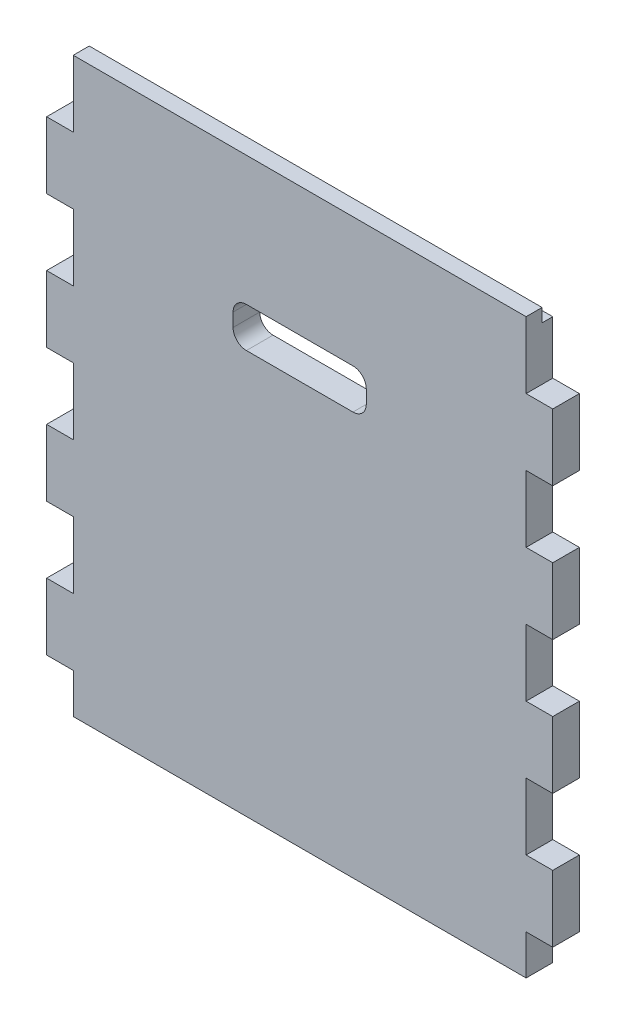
ISO-10303-21;
HEADER;
FILE_DESCRIPTION(('STEP AP214'),'2;1');
FILE_NAME('part.step','',(''),(''),'','','');
FILE_SCHEMA(('AUTOMOTIVE_DESIGN { 1 0 10303 214 1 1 1 1 }'));
ENDSEC;
DATA;
#1=APPLICATION_CONTEXT('core data for automotive mechanical design processes');
#2=APPLICATION_PROTOCOL_DEFINITION('international standard','automotive_design',2000,#1);
#3=PRODUCT_CONTEXT('',#1,'mechanical');
#4=PRODUCT('Part','Part','',(#3));
#5=PRODUCT_RELATED_PRODUCT_CATEGORY('part','',(#4));
#6=PRODUCT_DEFINITION_FORMATION('','',#4);
#7=PRODUCT_DEFINITION_CONTEXT('part definition',#1,'design');
#8=PRODUCT_DEFINITION('design','',#6,#7);
#9=PRODUCT_DEFINITION_SHAPE('','',#8);
#10=(LENGTH_UNIT() NAMED_UNIT(*) SI_UNIT(.MILLI.,.METRE.));
#11=(NAMED_UNIT(*) PLANE_ANGLE_UNIT() SI_UNIT($,.RADIAN.));
#12=(NAMED_UNIT(*) SI_UNIT($,.STERADIAN.) SOLID_ANGLE_UNIT());
#13=UNCERTAINTY_MEASURE_WITH_UNIT(LENGTH_MEASURE(1.E-05),#10,'distance_accuracy_value','');
#14=(GEOMETRIC_REPRESENTATION_CONTEXT(3) GLOBAL_UNCERTAINTY_ASSIGNED_CONTEXT((#13)) GLOBAL_UNIT_ASSIGNED_CONTEXT((#10,
#11,#12)) REPRESENTATION_CONTEXT('',''));
#15=CARTESIAN_POINT('',(0.,0.,0.));
#16=DIRECTION('',(0.,0.,1.));
#17=DIRECTION('',(1.,0.,0.));
#18=AXIS2_PLACEMENT_3D('',#15,#16,#17);
#19=CARTESIAN_POINT('',(19.9999999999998,450.,20.));
#20=DIRECTION('',(0.,-1.,0.));
#21=DIRECTION('',(0.,0.,-1.));
#22=AXIS2_PLACEMENT_3D('',#19,#20,#21);
#23=PLANE('',#22);
#24=DIRECTION('',(1.,0.,0.));
#25=VECTOR('',#24,1.);
#26=CARTESIAN_POINT('',(360.,450.,8.));
#27=LINE('',#26,#25);
#28=CARTESIAN_POINT('',(19.9999999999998,450.,8.));
#29=VERTEX_POINT('',#28);
#30=CARTESIAN_POINT('',(360.,450.,8.));
#31=VERTEX_POINT('',#30);
#32=EDGE_CURVE('E335',#29,#31,#27,.T.);
#33=ORIENTED_EDGE('',*,*,#32,.F.);
#34=DIRECTION('',(0.,0.,-1.));
#35=VECTOR('',#34,1.);
#36=CARTESIAN_POINT('',(19.9999999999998,450.,20.));
#37=LINE('',#36,#35);
#38=CARTESIAN_POINT('',(19.9999999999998,450.,20.));
#39=VERTEX_POINT('',#38);
#40=EDGE_CURVE('E604',#39,#29,#37,.T.);
#41=ORIENTED_EDGE('',*,*,#40,.F.);
#42=DIRECTION('',(-1.,0.,0.));
#43=VECTOR('',#42,1.);
#44=CARTESIAN_POINT('',(19.9999999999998,450.,20.));
#45=LINE('',#44,#43);
#46=CARTESIAN_POINT('',(360.,450.,20.));
#47=VERTEX_POINT('',#46);
#48=EDGE_CURVE('E454',#47,#39,#45,.T.);
#49=ORIENTED_EDGE('',*,*,#48,.F.);
#50=DIRECTION('',(0.,0.,-1.));
#51=VECTOR('',#50,1.);
#52=CARTESIAN_POINT('',(360.,450.,20.));
#53=LINE('',#52,#51);
#54=EDGE_CURVE('E607',#47,#31,#53,.T.);
#55=ORIENTED_EDGE('',*,*,#54,.T.);
#56=EDGE_LOOP('',(#33,#41,#49,#55));
#57=FACE_BOUND('',#56,.T.);
#58=ADVANCED_FACE('F31',(#57),#23,.F.);
#59=CARTESIAN_POINT('',(19.9999999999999,20.,20.));
#60=DIRECTION('',(1.,0.,0.));
#61=DIRECTION('',(0.,1.,0.));
#62=AXIS2_PLACEMENT_3D('',#59,#60,#61);
#63=PLANE('',#62);
#64=DIRECTION('',(0.,-1.,0.));
#65=VECTOR('',#64,1.);
#66=CARTESIAN_POINT('',(19.9999999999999,20.,0.));
#67=LINE('',#66,#65);
#68=CARTESIAN_POINT('',(20.,50.,0.));
#69=VERTEX_POINT('',#68);
#70=CARTESIAN_POINT('',(19.9999999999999,20.,0.));
#71=VERTEX_POINT('',#70);
#72=EDGE_CURVE('E400',#69,#71,#67,.T.);
#73=ORIENTED_EDGE('',*,*,#72,.T.);
#74=DIRECTION('',(0.,0.,-1.));
#75=VECTOR('',#74,1.);
#76=CARTESIAN_POINT('',(19.9999999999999,20.,20.));
#77=LINE('',#76,#75);
#78=CARTESIAN_POINT('',(19.9999999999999,20.,20.));
#79=VERTEX_POINT('',#78);
#80=EDGE_CURVE('E11',#79,#71,#77,.T.);
#81=ORIENTED_EDGE('',*,*,#80,.F.);
#82=DIRECTION('',(0.,-1.,0.));
#83=VECTOR('',#82,1.);
#84=CARTESIAN_POINT('',(19.9999999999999,20.,20.));
#85=LINE('',#84,#83);
#86=CARTESIAN_POINT('',(20.,50.,20.));
#87=VERTEX_POINT('',#86);
#88=EDGE_CURVE('E414',#87,#79,#85,.T.);
#89=ORIENTED_EDGE('',*,*,#88,.F.);
#90=DIRECTION('',(0.,0.,-1.));
#91=VECTOR('',#90,1.);
#92=CARTESIAN_POINT('',(20.,50.,20.));
#93=LINE('',#92,#91);
#94=EDGE_CURVE('E488',#87,#69,#93,.T.);
#95=ORIENTED_EDGE('',*,*,#94,.T.);
#96=EDGE_LOOP('',(#73,#81,#89,#95));
#97=FACE_BOUND('',#96,.T.);
#98=ADVANCED_FACE('F33',(#97),#63,.F.);
#99=CARTESIAN_POINT('',(360.,20.,20.));
#100=DIRECTION('',(0.,1.,0.));
#101=DIRECTION('',(-1.,0.,0.));
#102=AXIS2_PLACEMENT_3D('',#99,#100,#101);
#103=PLANE('',#102);
#104=DIRECTION('',(1.,0.,0.));
#105=VECTOR('',#104,1.);
#106=CARTESIAN_POINT('',(360.,20.,0.));
#107=LINE('',#106,#105);
#108=CARTESIAN_POINT('',(360.,20.,0.));
#109=VERTEX_POINT('',#108);
#110=EDGE_CURVE('E491',#71,#109,#107,.T.);
#111=ORIENTED_EDGE('',*,*,#110,.T.);
#112=DIRECTION('',(0.,0.,-1.));
#113=VECTOR('',#112,1.);
#114=CARTESIAN_POINT('',(360.,20.,20.));
#115=LINE('',#114,#113);
#116=CARTESIAN_POINT('',(360.,20.,20.));
#117=VERTEX_POINT('',#116);
#118=EDGE_CURVE('E39',#117,#109,#115,.T.);
#119=ORIENTED_EDGE('',*,*,#118,.F.);
#120=DIRECTION('',(1.,0.,0.));
#121=VECTOR('',#120,1.);
#122=CARTESIAN_POINT('',(360.,20.,20.));
#123=LINE('',#122,#121);
#124=EDGE_CURVE('E417',#79,#117,#123,.T.);
#125=ORIENTED_EDGE('',*,*,#124,.F.);
#126=ORIENTED_EDGE('',*,*,#80,.T.);
#127=EDGE_LOOP('',(#111,#119,#125,#126));
#128=FACE_BOUND('',#127,.T.);
#129=ADVANCED_FACE('F684',(#128),#103,.F.);
#130=CARTESIAN_POINT('',(360.,50.,20.));
#131=DIRECTION('',(-1.,0.,0.));
#132=DIRECTION('',(0.,0.,1.));
#133=AXIS2_PLACEMENT_3D('',#130,#131,#132);
#134=PLANE('',#133);
#135=DIRECTION('',(0.,1.,0.));
#136=VECTOR('',#135,1.);
#137=CARTESIAN_POINT('',(360.,50.,0.));
#138=LINE('',#137,#136);
#139=CARTESIAN_POINT('',(360.,50.,0.));
#140=VERTEX_POINT('',#139);
#141=EDGE_CURVE('E493',#109,#140,#138,.T.);
#142=ORIENTED_EDGE('',*,*,#141,.T.);
#143=DIRECTION('',(0.,0.,-1.));
#144=VECTOR('',#143,1.);
#145=CARTESIAN_POINT('',(360.,50.,20.));
#146=LINE('',#145,#144);
#147=CARTESIAN_POINT('',(360.,50.,20.));
#148=VERTEX_POINT('',#147);
#149=EDGE_CURVE('E653',#148,#140,#146,.T.);
#150=ORIENTED_EDGE('',*,*,#149,.F.);
#151=DIRECTION('',(0.,1.,0.));
#152=VECTOR('',#151,1.);
#153=CARTESIAN_POINT('',(360.,50.,20.));
#154=LINE('',#153,#152);
#155=EDGE_CURVE('E420',#117,#148,#154,.T.);
#156=ORIENTED_EDGE('',*,*,#155,.F.);
#157=ORIENTED_EDGE('',*,*,#118,.T.);
#158=EDGE_LOOP('',(#142,#150,#156,#157));
#159=FACE_BOUND('',#158,.T.);
#160=ADVANCED_FACE('F660',(#159),#134,.F.);
#161=CARTESIAN_POINT('',(360.,50.,20.));
#162=DIRECTION('',(0.,1.,0.));
#163=DIRECTION('',(-1.,0.,0.));
#164=AXIS2_PLACEMENT_3D('',#161,#162,#163);
#165=PLANE('',#164);
#166=DIRECTION('',(1.,0.,0.));
#167=VECTOR('',#166,1.);
#168=CARTESIAN_POINT('',(360.,50.,0.));
#169=LINE('',#168,#167);
#170=CARTESIAN_POINT('',(380.,50.,0.));
#171=VERTEX_POINT('',#170);
#172=EDGE_CURVE('E495',#140,#171,#169,.T.);
#173=ORIENTED_EDGE('',*,*,#172,.T.);
#174=DIRECTION('',(0.,0.,-1.));
#175=VECTOR('',#174,1.);
#176=CARTESIAN_POINT('',(380.,50.,20.));
#177=LINE('',#176,#175);
#178=CARTESIAN_POINT('',(380.,50.,20.));
#179=VERTEX_POINT('',#178);
#180=EDGE_CURVE('E650',#179,#171,#177,.T.);
#181=ORIENTED_EDGE('',*,*,#180,.F.);
#182=DIRECTION('',(1.,0.,0.));
#183=VECTOR('',#182,1.);
#184=CARTESIAN_POINT('',(360.,50.,20.));
#185=LINE('',#184,#183);
#186=EDGE_CURVE('E422',#148,#179,#185,.T.);
#187=ORIENTED_EDGE('',*,*,#186,.F.);
#188=ORIENTED_EDGE('',*,*,#149,.T.);
#189=EDGE_LOOP('',(#173,#181,#187,#188));
#190=FACE_BOUND('',#189,.T.);
#191=ADVANCED_FACE('F672',(#190),#165,.F.);
#192=CARTESIAN_POINT('',(380.,50.,20.));
#193=DIRECTION('',(-1.,0.,0.));
#194=DIRECTION('',(0.,-1.,0.));
#195=AXIS2_PLACEMENT_3D('',#192,#193,#194);
#196=PLANE('',#195);
#197=DIRECTION('',(0.,1.,0.));
#198=VECTOR('',#197,1.);
#199=CARTESIAN_POINT('',(380.,50.,0.));
#200=LINE('',#199,#198);
#201=CARTESIAN_POINT('',(380.,100.,0.));
#202=VERTEX_POINT('',#201);
#203=EDGE_CURVE('E497',#171,#202,#200,.T.);
#204=ORIENTED_EDGE('',*,*,#203,.T.);
#205=DIRECTION('',(0.,0.,-1.));
#206=VECTOR('',#205,1.);
#207=CARTESIAN_POINT('',(380.,100.,20.));
#208=LINE('',#207,#206);
#209=CARTESIAN_POINT('',(380.,100.,20.));
#210=VERTEX_POINT('',#209);
#211=EDGE_CURVE('E647',#210,#202,#208,.T.);
#212=ORIENTED_EDGE('',*,*,#211,.F.);
#213=DIRECTION('',(0.,1.,0.));
#214=VECTOR('',#213,1.);
#215=CARTESIAN_POINT('',(380.,50.,20.));
#216=LINE('',#215,#214);
#217=EDGE_CURVE('E424',#179,#210,#216,.T.);
#218=ORIENTED_EDGE('',*,*,#217,.F.);
#219=ORIENTED_EDGE('',*,*,#180,.T.);
#220=EDGE_LOOP('',(#204,#212,#218,#219));
#221=FACE_BOUND('',#220,.T.);
#222=ADVANCED_FACE('F676',(#221),#196,.F.);
#223=CARTESIAN_POINT('',(360.,100.,20.));
#224=DIRECTION('',(0.,-1.,0.));
#225=DIRECTION('',(1.,0.,0.));
#226=AXIS2_PLACEMENT_3D('',#223,#224,#225);
#227=PLANE('',#226);
#228=DIRECTION('',(-1.,0.,0.));
#229=VECTOR('',#228,1.);
#230=CARTESIAN_POINT('',(360.,100.,0.));
#231=LINE('',#230,#229);
#232=CARTESIAN_POINT('',(360.,100.,0.));
#233=VERTEX_POINT('',#232);
#234=EDGE_CURVE('E499',#202,#233,#231,.T.);
#235=ORIENTED_EDGE('',*,*,#234,.T.);
#236=DIRECTION('',(0.,0.,-1.));
#237=VECTOR('',#236,1.);
#238=CARTESIAN_POINT('',(360.,100.,20.));
#239=LINE('',#238,#237);
#240=CARTESIAN_POINT('',(360.,100.,20.));
#241=VERTEX_POINT('',#240);
#242=EDGE_CURVE('E644',#241,#233,#239,.T.);
#243=ORIENTED_EDGE('',*,*,#242,.F.);
#244=DIRECTION('',(-1.,0.,0.));
#245=VECTOR('',#244,1.);
#246=CARTESIAN_POINT('',(360.,100.,20.));
#247=LINE('',#246,#245);
#248=EDGE_CURVE('E426',#210,#241,#247,.T.);
#249=ORIENTED_EDGE('',*,*,#248,.F.);
#250=ORIENTED_EDGE('',*,*,#211,.T.);
#251=EDGE_LOOP('',(#235,#243,#249,#250));
#252=FACE_BOUND('',#251,.T.);
#253=ADVANCED_FACE('F832',(#252),#227,.F.);
#254=CARTESIAN_POINT('',(360.,150.,20.));
#255=DIRECTION('',(-1.,0.,0.));
#256=DIRECTION('',(0.,0.,1.));
#257=AXIS2_PLACEMENT_3D('',#254,#255,#256);
#258=PLANE('',#257);
#259=DIRECTION('',(0.,1.,0.));
#260=VECTOR('',#259,1.);
#261=CARTESIAN_POINT('',(360.,150.,0.));
#262=LINE('',#261,#260);
#263=CARTESIAN_POINT('',(360.,150.,0.));
#264=VERTEX_POINT('',#263);
#265=EDGE_CURVE('E501',#233,#264,#262,.T.);
#266=ORIENTED_EDGE('',*,*,#265,.T.);
#267=DIRECTION('',(0.,0.,-1.));
#268=VECTOR('',#267,1.);
#269=CARTESIAN_POINT('',(360.,150.,20.));
#270=LINE('',#269,#268);
#271=CARTESIAN_POINT('',(360.,150.,20.));
#272=VERTEX_POINT('',#271);
#273=EDGE_CURVE('E641',#272,#264,#270,.T.);
#274=ORIENTED_EDGE('',*,*,#273,.F.);
#275=DIRECTION('',(0.,1.,0.));
#276=VECTOR('',#275,1.);
#277=CARTESIAN_POINT('',(360.,150.,20.));
#278=LINE('',#277,#276);
#279=EDGE_CURVE('E428',#241,#272,#278,.T.);
#280=ORIENTED_EDGE('',*,*,#279,.F.);
#281=ORIENTED_EDGE('',*,*,#242,.T.);
#282=EDGE_LOOP('',(#266,#274,#280,#281));
#283=FACE_BOUND('',#282,.T.);
#284=ADVANCED_FACE('F830',(#283),#258,.F.);
#285=CARTESIAN_POINT('',(360.,150.,20.));
#286=DIRECTION('',(0.,1.,0.));
#287=DIRECTION('',(0.,0.,1.));
#288=AXIS2_PLACEMENT_3D('',#285,#286,#287);
#289=PLANE('',#288);
#290=DIRECTION('',(1.,0.,0.));
#291=VECTOR('',#290,1.);
#292=CARTESIAN_POINT('',(360.,150.,0.));
#293=LINE('',#292,#291);
#294=CARTESIAN_POINT('',(379.999999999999,150.,0.));
#295=VERTEX_POINT('',#294);
#296=EDGE_CURVE('E503',#264,#295,#293,.T.);
#297=ORIENTED_EDGE('',*,*,#296,.T.);
#298=DIRECTION('',(0.,0.,-1.));
#299=VECTOR('',#298,1.);
#300=CARTESIAN_POINT('',(379.999999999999,150.,20.));
#301=LINE('',#300,#299);
#302=CARTESIAN_POINT('',(379.999999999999,150.,20.));
#303=VERTEX_POINT('',#302);
#304=EDGE_CURVE('E638',#303,#295,#301,.T.);
#305=ORIENTED_EDGE('',*,*,#304,.F.);
#306=DIRECTION('',(1.,0.,0.));
#307=VECTOR('',#306,1.);
#308=CARTESIAN_POINT('',(360.,150.,20.));
#309=LINE('',#308,#307);
#310=EDGE_CURVE('E430',#272,#303,#309,.T.);
#311=ORIENTED_EDGE('',*,*,#310,.F.);
#312=ORIENTED_EDGE('',*,*,#273,.T.);
#313=EDGE_LOOP('',(#297,#305,#311,#312));
#314=FACE_BOUND('',#313,.T.);
#315=ADVANCED_FACE('F825',(#314),#289,.F.);
#316=CARTESIAN_POINT('',(379.999999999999,150.,20.));
#317=DIRECTION('',(-1.,0.,0.));
#318=DIRECTION('',(0.,-1.,0.));
#319=AXIS2_PLACEMENT_3D('',#316,#317,#318);
#320=PLANE('',#319);
#321=DIRECTION('',(0.,1.,0.));
#322=VECTOR('',#321,1.);
#323=CARTESIAN_POINT('',(379.999999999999,150.,0.));
#324=LINE('',#323,#322);
#325=CARTESIAN_POINT('',(379.999999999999,200.,0.));
#326=VERTEX_POINT('',#325);
#327=EDGE_CURVE('E505',#295,#326,#324,.T.);
#328=ORIENTED_EDGE('',*,*,#327,.T.);
#329=DIRECTION('',(0.,0.,-1.));
#330=VECTOR('',#329,1.);
#331=CARTESIAN_POINT('',(379.999999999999,200.,20.));
#332=LINE('',#331,#330);
#333=CARTESIAN_POINT('',(379.999999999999,200.,20.));
#334=VERTEX_POINT('',#333);
#335=EDGE_CURVE('E635',#334,#326,#332,.T.);
#336=ORIENTED_EDGE('',*,*,#335,.F.);
#337=DIRECTION('',(0.,1.,0.));
#338=VECTOR('',#337,1.);
#339=CARTESIAN_POINT('',(379.999999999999,150.,20.));
#340=LINE('',#339,#338);
#341=EDGE_CURVE('E432',#303,#334,#340,.T.);
#342=ORIENTED_EDGE('',*,*,#341,.F.);
#343=ORIENTED_EDGE('',*,*,#304,.T.);
#344=EDGE_LOOP('',(#328,#336,#342,#343));
#345=FACE_BOUND('',#344,.T.);
#346=ADVANCED_FACE('F820',(#345),#320,.F.);
#347=CARTESIAN_POINT('',(360.,200.,20.));
#348=DIRECTION('',(0.,-1.,0.));
#349=DIRECTION('',(0.,0.,-1.));
#350=AXIS2_PLACEMENT_3D('',#347,#348,#349);
#351=PLANE('',#350);
#352=DIRECTION('',(-1.,0.,0.));
#353=VECTOR('',#352,1.);
#354=CARTESIAN_POINT('',(360.,200.,0.));
#355=LINE('',#354,#353);
#356=CARTESIAN_POINT('',(360.,200.,0.));
#357=VERTEX_POINT('',#356);
#358=EDGE_CURVE('E507',#326,#357,#355,.T.);
#359=ORIENTED_EDGE('',*,*,#358,.T.);
#360=DIRECTION('',(0.,0.,-1.));
#361=VECTOR('',#360,1.);
#362=CARTESIAN_POINT('',(360.,200.,20.));
#363=LINE('',#362,#361);
#364=CARTESIAN_POINT('',(360.,200.,20.));
#365=VERTEX_POINT('',#364);
#366=EDGE_CURVE('E632',#365,#357,#363,.T.);
#367=ORIENTED_EDGE('',*,*,#366,.F.);
#368=DIRECTION('',(-1.,0.,0.));
#369=VECTOR('',#368,1.);
#370=CARTESIAN_POINT('',(360.,200.,20.));
#371=LINE('',#370,#369);
#372=EDGE_CURVE('E434',#334,#365,#371,.T.);
#373=ORIENTED_EDGE('',*,*,#372,.F.);
#374=ORIENTED_EDGE('',*,*,#335,.T.);
#375=EDGE_LOOP('',(#359,#367,#373,#374));
#376=FACE_BOUND('',#375,.T.);
#377=ADVANCED_FACE('F816',(#376),#351,.F.);
#378=CARTESIAN_POINT('',(360.,250.,20.));
#379=DIRECTION('',(-1.,0.,0.));
#380=DIRECTION('',(0.,-1.,0.));
#381=AXIS2_PLACEMENT_3D('',#378,#379,#380);
#382=PLANE('',#381);
#383=DIRECTION('',(0.,1.,0.));
#384=VECTOR('',#383,1.);
#385=CARTESIAN_POINT('',(360.,250.,0.));
#386=LINE('',#385,#384);
#387=CARTESIAN_POINT('',(360.,250.,0.));
#388=VERTEX_POINT('',#387);
#389=EDGE_CURVE('E509',#357,#388,#386,.T.);
#390=ORIENTED_EDGE('',*,*,#389,.T.);
#391=DIRECTION('',(0.,0.,-1.));
#392=VECTOR('',#391,1.);
#393=CARTESIAN_POINT('',(360.,250.,20.));
#394=LINE('',#393,#392);
#395=CARTESIAN_POINT('',(360.,250.,20.));
#396=VERTEX_POINT('',#395);
#397=EDGE_CURVE('E629',#396,#388,#394,.T.);
#398=ORIENTED_EDGE('',*,*,#397,.F.);
#399=DIRECTION('',(0.,1.,0.));
#400=VECTOR('',#399,1.);
#401=CARTESIAN_POINT('',(360.,250.,20.));
#402=LINE('',#401,#400);
#403=EDGE_CURVE('E436',#365,#396,#402,.T.);
#404=ORIENTED_EDGE('',*,*,#403,.F.);
#405=ORIENTED_EDGE('',*,*,#366,.T.);
#406=EDGE_LOOP('',(#390,#398,#404,#405));
#407=FACE_BOUND('',#406,.T.);
#408=ADVANCED_FACE('F811',(#407),#382,.F.);
#409=CARTESIAN_POINT('',(360.,250.,20.));
#410=DIRECTION('',(0.,1.,0.));
#411=DIRECTION('',(0.,0.,1.));
#412=AXIS2_PLACEMENT_3D('',#409,#410,#411);
#413=PLANE('',#412);
#414=DIRECTION('',(1.,0.,0.));
#415=VECTOR('',#414,1.);
#416=CARTESIAN_POINT('',(360.,250.,0.));
#417=LINE('',#416,#415);
#418=CARTESIAN_POINT('',(379.999999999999,250.,0.));
#419=VERTEX_POINT('',#418);
#420=EDGE_CURVE('E511',#388,#419,#417,.T.);
#421=ORIENTED_EDGE('',*,*,#420,.T.);
#422=DIRECTION('',(0.,0.,-1.));
#423=VECTOR('',#422,1.);
#424=CARTESIAN_POINT('',(379.999999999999,250.,20.));
#425=LINE('',#424,#423);
#426=CARTESIAN_POINT('',(379.999999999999,250.,20.));
#427=VERTEX_POINT('',#426);
#428=EDGE_CURVE('E626',#427,#419,#425,.T.);
#429=ORIENTED_EDGE('',*,*,#428,.F.);
#430=DIRECTION('',(1.,0.,0.));
#431=VECTOR('',#430,1.);
#432=CARTESIAN_POINT('',(360.,250.,20.));
#433=LINE('',#432,#431);
#434=EDGE_CURVE('E438',#396,#427,#433,.T.);
#435=ORIENTED_EDGE('',*,*,#434,.F.);
#436=ORIENTED_EDGE('',*,*,#397,.T.);
#437=EDGE_LOOP('',(#421,#429,#435,#436));
#438=FACE_BOUND('',#437,.T.);
#439=ADVANCED_FACE('F805',(#438),#413,.F.);
#440=CARTESIAN_POINT('',(379.999999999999,250.,20.));
#441=DIRECTION('',(-1.,0.,0.));
#442=DIRECTION('',(0.,-1.,0.));
#443=AXIS2_PLACEMENT_3D('',#440,#441,#442);
#444=PLANE('',#443);
#445=DIRECTION('',(0.,1.,0.));
#446=VECTOR('',#445,1.);
#447=CARTESIAN_POINT('',(379.999999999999,250.,0.));
#448=LINE('',#447,#446);
#449=CARTESIAN_POINT('',(379.999999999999,300.,0.));
#450=VERTEX_POINT('',#449);
#451=EDGE_CURVE('E513',#419,#450,#448,.T.);
#452=ORIENTED_EDGE('',*,*,#451,.T.);
#453=DIRECTION('',(0.,0.,-1.));
#454=VECTOR('',#453,1.);
#455=CARTESIAN_POINT('',(379.999999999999,300.,20.));
#456=LINE('',#455,#454);
#457=CARTESIAN_POINT('',(379.999999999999,300.,20.));
#458=VERTEX_POINT('',#457);
#459=EDGE_CURVE('E623',#458,#450,#456,.T.);
#460=ORIENTED_EDGE('',*,*,#459,.F.);
#461=DIRECTION('',(0.,1.,0.));
#462=VECTOR('',#461,1.);
#463=CARTESIAN_POINT('',(379.999999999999,250.,20.));
#464=LINE('',#463,#462);
#465=EDGE_CURVE('E440',#427,#458,#464,.T.);
#466=ORIENTED_EDGE('',*,*,#465,.F.);
#467=ORIENTED_EDGE('',*,*,#428,.T.);
#468=EDGE_LOOP('',(#452,#460,#466,#467));
#469=FACE_BOUND('',#468,.T.);
#470=ADVANCED_FACE('F801',(#469),#444,.F.);
#471=CARTESIAN_POINT('',(360.,300.,20.));
#472=DIRECTION('',(0.,-1.,0.));
#473=DIRECTION('',(0.,0.,-1.));
#474=AXIS2_PLACEMENT_3D('',#471,#472,#473);
#475=PLANE('',#474);
#476=DIRECTION('',(-1.,0.,0.));
#477=VECTOR('',#476,1.);
#478=CARTESIAN_POINT('',(360.,300.,0.));
#479=LINE('',#478,#477);
#480=CARTESIAN_POINT('',(360.,300.,0.));
#481=VERTEX_POINT('',#480);
#482=EDGE_CURVE('E515',#450,#481,#479,.T.);
#483=ORIENTED_EDGE('',*,*,#482,.T.);
#484=DIRECTION('',(0.,0.,-1.));
#485=VECTOR('',#484,1.);
#486=CARTESIAN_POINT('',(360.,300.,20.));
#487=LINE('',#486,#485);
#488=CARTESIAN_POINT('',(360.,300.,20.));
#489=VERTEX_POINT('',#488);
#490=EDGE_CURVE('E620',#489,#481,#487,.T.);
#491=ORIENTED_EDGE('',*,*,#490,.F.);
#492=DIRECTION('',(-1.,0.,0.));
#493=VECTOR('',#492,1.);
#494=CARTESIAN_POINT('',(360.,300.,20.));
#495=LINE('',#494,#493);
#496=EDGE_CURVE('E442',#458,#489,#495,.T.);
#497=ORIENTED_EDGE('',*,*,#496,.F.);
#498=ORIENTED_EDGE('',*,*,#459,.T.);
#499=EDGE_LOOP('',(#483,#491,#497,#498));
#500=FACE_BOUND('',#499,.T.);
#501=ADVANCED_FACE('F796',(#500),#475,.F.);
#502=CARTESIAN_POINT('',(360.,350.,20.));
#503=DIRECTION('',(-1.,0.,0.));
#504=DIRECTION('',(0.,0.,1.));
#505=AXIS2_PLACEMENT_3D('',#502,#503,#504);
#506=PLANE('',#505);
#507=DIRECTION('',(0.,1.,0.));
#508=VECTOR('',#507,1.);
#509=CARTESIAN_POINT('',(360.,350.,0.));
#510=LINE('',#509,#508);
#511=CARTESIAN_POINT('',(360.,350.,0.));
#512=VERTEX_POINT('',#511);
#513=EDGE_CURVE('E517',#481,#512,#510,.T.);
#514=ORIENTED_EDGE('',*,*,#513,.T.);
#515=DIRECTION('',(0.,0.,-1.));
#516=VECTOR('',#515,1.);
#517=CARTESIAN_POINT('',(360.,350.,20.));
#518=LINE('',#517,#516);
#519=CARTESIAN_POINT('',(360.,350.,20.));
#520=VERTEX_POINT('',#519);
#521=EDGE_CURVE('E617',#520,#512,#518,.T.);
#522=ORIENTED_EDGE('',*,*,#521,.F.);
#523=DIRECTION('',(0.,1.,0.));
#524=VECTOR('',#523,1.);
#525=CARTESIAN_POINT('',(360.,350.,20.));
#526=LINE('',#525,#524);
#527=EDGE_CURVE('E444',#489,#520,#526,.T.);
#528=ORIENTED_EDGE('',*,*,#527,.F.);
#529=ORIENTED_EDGE('',*,*,#490,.T.);
#530=EDGE_LOOP('',(#514,#522,#528,#529));
#531=FACE_BOUND('',#530,.T.);
#532=ADVANCED_FACE('F790',(#531),#506,.F.);
#533=CARTESIAN_POINT('',(360.,350.,20.));
#534=DIRECTION('',(0.,1.,0.));
#535=DIRECTION('',(0.,0.,1.));
#536=AXIS2_PLACEMENT_3D('',#533,#534,#535);
#537=PLANE('',#536);
#538=DIRECTION('',(1.,0.,0.));
#539=VECTOR('',#538,1.);
#540=CARTESIAN_POINT('',(360.,350.,0.));
#541=LINE('',#540,#539);
#542=CARTESIAN_POINT('',(379.999999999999,350.,0.));
#543=VERTEX_POINT('',#542);
#544=EDGE_CURVE('E519',#512,#543,#541,.T.);
#545=ORIENTED_EDGE('',*,*,#544,.T.);
#546=DIRECTION('',(0.,0.,-1.));
#547=VECTOR('',#546,1.);
#548=CARTESIAN_POINT('',(379.999999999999,350.,20.));
#549=LINE('',#548,#547);
#550=CARTESIAN_POINT('',(379.999999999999,350.,20.));
#551=VERTEX_POINT('',#550);
#552=EDGE_CURVE('E614',#551,#543,#549,.T.);
#553=ORIENTED_EDGE('',*,*,#552,.F.);
#554=DIRECTION('',(1.,0.,0.));
#555=VECTOR('',#554,1.);
#556=CARTESIAN_POINT('',(360.,350.,20.));
#557=LINE('',#556,#555);
#558=EDGE_CURVE('E446',#520,#551,#557,.T.);
#559=ORIENTED_EDGE('',*,*,#558,.F.);
#560=ORIENTED_EDGE('',*,*,#521,.T.);
#561=EDGE_LOOP('',(#545,#553,#559,#560));
#562=FACE_BOUND('',#561,.T.);
#563=ADVANCED_FACE('F786',(#562),#537,.F.);
#564=CARTESIAN_POINT('',(379.999999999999,350.,20.));
#565=DIRECTION('',(-1.,0.,0.));
#566=DIRECTION('',(0.,-1.,0.));
#567=AXIS2_PLACEMENT_3D('',#564,#565,#566);
#568=PLANE('',#567);
#569=DIRECTION('',(0.,1.,0.));
#570=VECTOR('',#569,1.);
#571=CARTESIAN_POINT('',(379.999999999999,350.,0.));
#572=LINE('',#571,#570);
#573=CARTESIAN_POINT('',(379.999999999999,400.,0.));
#574=VERTEX_POINT('',#573);
#575=EDGE_CURVE('E521',#543,#574,#572,.T.);
#576=ORIENTED_EDGE('',*,*,#575,.T.);
#577=DIRECTION('',(0.,0.,-1.));
#578=VECTOR('',#577,1.);
#579=CARTESIAN_POINT('',(379.999999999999,400.,20.));
#580=LINE('',#579,#578);
#581=CARTESIAN_POINT('',(379.999999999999,400.,20.));
#582=VERTEX_POINT('',#581);
#583=EDGE_CURVE('E611',#582,#574,#580,.T.);
#584=ORIENTED_EDGE('',*,*,#583,.F.);
#585=DIRECTION('',(0.,1.,0.));
#586=VECTOR('',#585,1.);
#587=CARTESIAN_POINT('',(379.999999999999,350.,20.));
#588=LINE('',#587,#586);
#589=EDGE_CURVE('E448',#551,#582,#588,.T.);
#590=ORIENTED_EDGE('',*,*,#589,.F.);
#591=ORIENTED_EDGE('',*,*,#552,.T.);
#592=EDGE_LOOP('',(#576,#584,#590,#591));
#593=FACE_BOUND('',#592,.T.);
#594=ADVANCED_FACE('F782',(#593),#568,.F.);
#595=CARTESIAN_POINT('',(360.,400.,20.));
#596=DIRECTION('',(0.,-1.,0.));
#597=DIRECTION('',(0.,0.,-1.));
#598=AXIS2_PLACEMENT_3D('',#595,#596,#597);
#599=PLANE('',#598);
#600=DIRECTION('',(-1.,0.,0.));
#601=VECTOR('',#600,1.);
#602=CARTESIAN_POINT('',(360.,400.,0.));
#603=LINE('',#602,#601);
#604=CARTESIAN_POINT('',(360.,400.,0.));
#605=VERTEX_POINT('',#604);
#606=EDGE_CURVE('E523',#574,#605,#603,.T.);
#607=ORIENTED_EDGE('',*,*,#606,.T.);
#608=DIRECTION('',(0.,0.,-1.));
#609=VECTOR('',#608,1.);
#610=CARTESIAN_POINT('',(360.,400.,20.));
#611=LINE('',#610,#609);
#612=CARTESIAN_POINT('',(360.,400.,20.));
#613=VERTEX_POINT('',#612);
#614=EDGE_CURVE('E609',#613,#605,#611,.T.);
#615=ORIENTED_EDGE('',*,*,#614,.F.);
#616=DIRECTION('',(-1.,0.,0.));
#617=VECTOR('',#616,1.);
#618=CARTESIAN_POINT('',(360.,400.,20.));
#619=LINE('',#618,#617);
#620=EDGE_CURVE('E450',#582,#613,#619,.T.);
#621=ORIENTED_EDGE('',*,*,#620,.F.);
#622=ORIENTED_EDGE('',*,*,#583,.T.);
#623=EDGE_LOOP('',(#607,#615,#621,#622));
#624=FACE_BOUND('',#623,.T.);
#625=ADVANCED_FACE('F776',(#624),#599,.F.);
#626=CARTESIAN_POINT('',(360.,450.,20.));
#627=DIRECTION('',(-1.,0.,0.));
#628=DIRECTION('',(0.,0.,1.));
#629=AXIS2_PLACEMENT_3D('',#626,#627,#628);
#630=PLANE('',#629);
#631=DIRECTION('',(0.,1.,0.));
#632=VECTOR('',#631,1.);
#633=CARTESIAN_POINT('',(360.,450.,0.));
#634=LINE('',#633,#632);
#635=CARTESIAN_POINT('',(360.,440.,0.));
#636=VERTEX_POINT('',#635);
#637=EDGE_CURVE('E345',#605,#636,#634,.T.);
#638=ORIENTED_EDGE('',*,*,#637,.T.);
#639=DIRECTION('',(0.,0.,-1.));
#640=VECTOR('',#639,1.);
#641=CARTESIAN_POINT('',(360.,440.,8.));
#642=LINE('',#641,#640);
#643=CARTESIAN_POINT('',(360.,440.,8.));
#644=VERTEX_POINT('',#643);
#645=EDGE_CURVE('E46',#644,#636,#642,.T.);
#646=ORIENTED_EDGE('',*,*,#645,.F.);
#647=DIRECTION('',(0.,-1.,0.));
#648=VECTOR('',#647,1.);
#649=CARTESIAN_POINT('',(360.,450.,8.));
#650=LINE('',#649,#648);
#651=EDGE_CURVE('E330',#31,#644,#650,.T.);
#652=ORIENTED_EDGE('',*,*,#651,.F.);
#653=ORIENTED_EDGE('',*,*,#54,.F.);
#654=DIRECTION('',(0.,1.,0.));
#655=VECTOR('',#654,1.);
#656=CARTESIAN_POINT('',(360.,450.,20.));
#657=LINE('',#656,#655);
#658=EDGE_CURVE('E452',#613,#47,#657,.T.);
#659=ORIENTED_EDGE('',*,*,#658,.F.);
#660=ORIENTED_EDGE('',*,*,#614,.T.);
#661=EDGE_LOOP('',(#638,#646,#652,#653,#659,#660));
#662=FACE_BOUND('',#661,.T.);
#663=ADVANCED_FACE('F342',(#662),#630,.F.);
#664=CARTESIAN_POINT('',(20.,400.,20.));
#665=DIRECTION('',(1.,0.,0.));
#666=DIRECTION('',(0.,1.,0.));
#667=AXIS2_PLACEMENT_3D('',#664,#665,#666);
#668=PLANE('',#667);
#669=DIRECTION('',(0.,1.,0.));
#670=VECTOR('',#669,1.);
#671=CARTESIAN_POINT('',(19.9999999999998,450.,8.));
#672=LINE('',#671,#670);
#673=CARTESIAN_POINT('',(19.9999999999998,440.,8.));
#674=VERTEX_POINT('',#673);
#675=EDGE_CURVE('E329',#674,#29,#672,.T.);
#676=ORIENTED_EDGE('',*,*,#675,.F.);
#677=DIRECTION('',(0.,0.,-1.));
#678=VECTOR('',#677,1.);
#679=CARTESIAN_POINT('',(19.9999999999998,440.,8.));
#680=LINE('',#679,#678);
#681=CARTESIAN_POINT('',(19.9999999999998,440.,0.));
#682=VERTEX_POINT('',#681);
#683=EDGE_CURVE('E326',#674,#682,#680,.T.);
#684=ORIENTED_EDGE('',*,*,#683,.T.);
#685=DIRECTION('',(0.,-1.,0.));
#686=VECTOR('',#685,1.);
#687=CARTESIAN_POINT('',(20.,400.,0.));
#688=LINE('',#687,#686);
#689=CARTESIAN_POINT('',(20.,400.,0.));
#690=VERTEX_POINT('',#689);
#691=EDGE_CURVE('E526',#682,#690,#688,.T.);
#692=ORIENTED_EDGE('',*,*,#691,.T.);
#693=DIRECTION('',(0.,0.,-1.));
#694=VECTOR('',#693,1.);
#695=CARTESIAN_POINT('',(20.,400.,20.));
#696=LINE('',#695,#694);
#697=CARTESIAN_POINT('',(20.,400.,20.));
#698=VERTEX_POINT('',#697);
#699=EDGE_CURVE('E601',#698,#690,#696,.T.);
#700=ORIENTED_EDGE('',*,*,#699,.F.);
#701=DIRECTION('',(0.,-1.,0.));
#702=VECTOR('',#701,1.);
#703=CARTESIAN_POINT('',(20.,400.,20.));
#704=LINE('',#703,#702);
#705=EDGE_CURVE('E456',#39,#698,#704,.T.);
#706=ORIENTED_EDGE('',*,*,#705,.F.);
#707=ORIENTED_EDGE('',*,*,#40,.T.);
#708=EDGE_LOOP('',(#676,#684,#692,#700,#706,#707));
#709=FACE_BOUND('',#708,.T.);
#710=ADVANCED_FACE('F764',(#709),#668,.F.);
#711=CARTESIAN_POINT('',(-1.39659334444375E-12,400.,20.));
#712=DIRECTION('',(0.,-1.,0.));
#713=DIRECTION('',(0.,0.,-1.));
#714=AXIS2_PLACEMENT_3D('',#711,#712,#713);
#715=PLANE('',#714);
#716=DIRECTION('',(-1.,0.,0.));
#717=VECTOR('',#716,1.);
#718=CARTESIAN_POINT('',(-1.39659334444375E-12,400.,0.));
#719=LINE('',#718,#717);
#720=CARTESIAN_POINT('',(-1.39659334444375E-12,400.,0.));
#721=VERTEX_POINT('',#720);
#722=EDGE_CURVE('E528',#690,#721,#719,.T.);
#723=ORIENTED_EDGE('',*,*,#722,.T.);
#724=DIRECTION('',(0.,0.,-1.));
#725=VECTOR('',#724,1.);
#726=CARTESIAN_POINT('',(-1.39659334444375E-12,400.,20.));
#727=LINE('',#726,#725);
#728=CARTESIAN_POINT('',(-1.39659334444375E-12,400.,20.));
#729=VERTEX_POINT('',#728);
#730=EDGE_CURVE('E598',#729,#721,#727,.T.);
#731=ORIENTED_EDGE('',*,*,#730,.F.);
#732=DIRECTION('',(-1.,0.,0.));
#733=VECTOR('',#732,1.);
#734=CARTESIAN_POINT('',(-1.39659334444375E-12,400.,20.));
#735=LINE('',#734,#733);
#736=EDGE_CURVE('E458',#698,#729,#735,.T.);
#737=ORIENTED_EDGE('',*,*,#736,.F.);
#738=ORIENTED_EDGE('',*,*,#699,.T.);
#739=EDGE_LOOP('',(#723,#731,#737,#738));
#740=FACE_BOUND('',#739,.T.);
#741=ADVANCED_FACE('F760',(#740),#715,.F.);
#742=CARTESIAN_POINT('',(-1.22201917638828E-12,350.,20.));
#743=DIRECTION('',(1.,0.,0.));
#744=DIRECTION('',(0.,1.,0.));
#745=AXIS2_PLACEMENT_3D('',#742,#743,#744);
#746=PLANE('',#745);
#747=DIRECTION('',(0.,-1.,0.));
#748=VECTOR('',#747,1.);
#749=CARTESIAN_POINT('',(-1.22201917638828E-12,350.,0.));
#750=LINE('',#749,#748);
#751=CARTESIAN_POINT('',(-1.22201917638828E-12,350.,0.));
#752=VERTEX_POINT('',#751);
#753=EDGE_CURVE('E530',#721,#752,#750,.T.);
#754=ORIENTED_EDGE('',*,*,#753,.T.);
#755=DIRECTION('',(0.,0.,-1.));
#756=VECTOR('',#755,1.);
#757=CARTESIAN_POINT('',(-1.22201917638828E-12,350.,20.));
#758=LINE('',#757,#756);
#759=CARTESIAN_POINT('',(-1.22201917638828E-12,350.,20.));
#760=VERTEX_POINT('',#759);
#761=EDGE_CURVE('E595',#760,#752,#758,.T.);
#762=ORIENTED_EDGE('',*,*,#761,.F.);
#763=DIRECTION('',(0.,-1.,0.));
#764=VECTOR('',#763,1.);
#765=CARTESIAN_POINT('',(-1.22201917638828E-12,350.,20.));
#766=LINE('',#765,#764);
#767=EDGE_CURVE('E460',#729,#760,#766,.T.);
#768=ORIENTED_EDGE('',*,*,#767,.F.);
#769=ORIENTED_EDGE('',*,*,#730,.T.);
#770=EDGE_LOOP('',(#754,#762,#768,#769));
#771=FACE_BOUND('',#770,.T.);
#772=ADVANCED_FACE('F756',(#771),#746,.F.);
#773=CARTESIAN_POINT('',(-1.22201917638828E-12,350.,20.));
#774=DIRECTION('',(0.,1.,0.));
#775=DIRECTION('',(0.,0.,1.));
#776=AXIS2_PLACEMENT_3D('',#773,#774,#775);
#777=PLANE('',#776);
#778=DIRECTION('',(1.,0.,0.));
#779=VECTOR('',#778,1.);
#780=CARTESIAN_POINT('',(-1.22201917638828E-12,350.,0.));
#781=LINE('',#780,#779);
#782=CARTESIAN_POINT('',(20.,350.,0.));
#783=VERTEX_POINT('',#782);
#784=EDGE_CURVE('E532',#752,#783,#781,.T.);
#785=ORIENTED_EDGE('',*,*,#784,.T.);
#786=DIRECTION('',(0.,0.,-1.));
#787=VECTOR('',#786,1.);
#788=CARTESIAN_POINT('',(20.,350.,20.));
#789=LINE('',#788,#787);
#790=CARTESIAN_POINT('',(20.,350.,20.));
#791=VERTEX_POINT('',#790);
#792=EDGE_CURVE('E592',#791,#783,#789,.T.);
#793=ORIENTED_EDGE('',*,*,#792,.F.);
#794=DIRECTION('',(1.,0.,0.));
#795=VECTOR('',#794,1.);
#796=CARTESIAN_POINT('',(-1.22201917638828E-12,350.,20.));
#797=LINE('',#796,#795);
#798=EDGE_CURVE('E462',#760,#791,#797,.T.);
#799=ORIENTED_EDGE('',*,*,#798,.F.);
#800=ORIENTED_EDGE('',*,*,#761,.T.);
#801=EDGE_LOOP('',(#785,#793,#799,#800));
#802=FACE_BOUND('',#801,.T.);
#803=ADVANCED_FACE('F751',(#802),#777,.F.);
#804=CARTESIAN_POINT('',(20.,300.,20.));
#805=DIRECTION('',(1.,0.,0.));
#806=DIRECTION('',(0.,0.,-1.));
#807=AXIS2_PLACEMENT_3D('',#804,#805,#806);
#808=PLANE('',#807);
#809=DIRECTION('',(0.,-1.,0.));
#810=VECTOR('',#809,1.);
#811=CARTESIAN_POINT('',(20.,300.,0.));
#812=LINE('',#811,#810);
#813=CARTESIAN_POINT('',(20.,300.,0.));
#814=VERTEX_POINT('',#813);
#815=EDGE_CURVE('E534',#783,#814,#812,.T.);
#816=ORIENTED_EDGE('',*,*,#815,.T.);
#817=DIRECTION('',(0.,0.,-1.));
#818=VECTOR('',#817,1.);
#819=CARTESIAN_POINT('',(20.,300.,20.));
#820=LINE('',#819,#818);
#821=CARTESIAN_POINT('',(20.,300.,20.));
#822=VERTEX_POINT('',#821);
#823=EDGE_CURVE('E589',#822,#814,#820,.T.);
#824=ORIENTED_EDGE('',*,*,#823,.F.);
#825=DIRECTION('',(0.,-1.,0.));
#826=VECTOR('',#825,1.);
#827=CARTESIAN_POINT('',(20.,300.,20.));
#828=LINE('',#827,#826);
#829=EDGE_CURVE('E464',#791,#822,#828,.T.);
#830=ORIENTED_EDGE('',*,*,#829,.F.);
#831=ORIENTED_EDGE('',*,*,#792,.T.);
#832=EDGE_LOOP('',(#816,#824,#830,#831));
#833=FACE_BOUND('',#832,.T.);
#834=ADVANCED_FACE('F745',(#833),#808,.F.);
#835=CARTESIAN_POINT('',(-1.04744500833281E-12,300.,20.));
#836=DIRECTION('',(0.,-1.,0.));
#837=DIRECTION('',(0.,0.,-1.));
#838=AXIS2_PLACEMENT_3D('',#835,#836,#837);
#839=PLANE('',#838);
#840=DIRECTION('',(-1.,0.,0.));
#841=VECTOR('',#840,1.);
#842=CARTESIAN_POINT('',(-1.04744500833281E-12,300.,0.));
#843=LINE('',#842,#841);
#844=CARTESIAN_POINT('',(-1.04744500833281E-12,300.,0.));
#845=VERTEX_POINT('',#844);
#846=EDGE_CURVE('E536',#814,#845,#843,.T.);
#847=ORIENTED_EDGE('',*,*,#846,.T.);
#848=DIRECTION('',(0.,0.,-1.));
#849=VECTOR('',#848,1.);
#850=CARTESIAN_POINT('',(-1.04744500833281E-12,300.,20.));
#851=LINE('',#850,#849);
#852=CARTESIAN_POINT('',(-1.04744500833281E-12,300.,20.));
#853=VERTEX_POINT('',#852);
#854=EDGE_CURVE('E586',#853,#845,#851,.T.);
#855=ORIENTED_EDGE('',*,*,#854,.F.);
#856=DIRECTION('',(-1.,0.,0.));
#857=VECTOR('',#856,1.);
#858=CARTESIAN_POINT('',(-1.04744500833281E-12,300.,20.));
#859=LINE('',#858,#857);
#860=EDGE_CURVE('E466',#822,#853,#859,.T.);
#861=ORIENTED_EDGE('',*,*,#860,.F.);
#862=ORIENTED_EDGE('',*,*,#823,.T.);
#863=EDGE_LOOP('',(#847,#855,#861,#862));
#864=FACE_BOUND('',#863,.T.);
#865=ADVANCED_FACE('F741',(#864),#839,.F.);
#866=CARTESIAN_POINT('',(-8.72870840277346E-13,250.,20.));
#867=DIRECTION('',(1.,0.,0.));
#868=DIRECTION('',(0.,1.,0.));
#869=AXIS2_PLACEMENT_3D('',#866,#867,#868);
#870=PLANE('',#869);
#871=DIRECTION('',(0.,-1.,0.));
#872=VECTOR('',#871,1.);
#873=CARTESIAN_POINT('',(-8.72870840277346E-13,250.,0.));
#874=LINE('',#873,#872);
#875=CARTESIAN_POINT('',(-8.72870840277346E-13,250.,0.));
#876=VERTEX_POINT('',#875);
#877=EDGE_CURVE('E538',#845,#876,#874,.T.);
#878=ORIENTED_EDGE('',*,*,#877,.T.);
#879=DIRECTION('',(0.,0.,-1.));
#880=VECTOR('',#879,1.);
#881=CARTESIAN_POINT('',(-8.72870840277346E-13,250.,20.));
#882=LINE('',#881,#880);
#883=CARTESIAN_POINT('',(-8.72870840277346E-13,250.,20.));
#884=VERTEX_POINT('',#883);
#885=EDGE_CURVE('E583',#884,#876,#882,.T.);
#886=ORIENTED_EDGE('',*,*,#885,.F.);
#887=DIRECTION('',(0.,-1.,0.));
#888=VECTOR('',#887,1.);
#889=CARTESIAN_POINT('',(-8.72870840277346E-13,250.,20.));
#890=LINE('',#889,#888);
#891=EDGE_CURVE('E468',#853,#884,#890,.T.);
#892=ORIENTED_EDGE('',*,*,#891,.F.);
#893=ORIENTED_EDGE('',*,*,#854,.T.);
#894=EDGE_LOOP('',(#878,#886,#892,#893));
#895=FACE_BOUND('',#894,.T.);
#896=ADVANCED_FACE('F736',(#895),#870,.F.);
#897=CARTESIAN_POINT('',(-8.72870840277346E-13,250.,20.));
#898=DIRECTION('',(0.,1.,0.));
#899=DIRECTION('',(0.,0.,1.));
#900=AXIS2_PLACEMENT_3D('',#897,#898,#899);
#901=PLANE('',#900);
#902=DIRECTION('',(1.,0.,0.));
#903=VECTOR('',#902,1.);
#904=CARTESIAN_POINT('',(-8.72870840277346E-13,250.,0.));
#905=LINE('',#904,#903);
#906=CARTESIAN_POINT('',(20.,250.,0.));
#907=VERTEX_POINT('',#906);
#908=EDGE_CURVE('E540',#876,#907,#905,.T.);
#909=ORIENTED_EDGE('',*,*,#908,.T.);
#910=DIRECTION('',(0.,0.,-1.));
#911=VECTOR('',#910,1.);
#912=CARTESIAN_POINT('',(20.,250.,20.));
#913=LINE('',#912,#911);
#914=CARTESIAN_POINT('',(20.,250.,20.));
#915=VERTEX_POINT('',#914);
#916=EDGE_CURVE('E580',#915,#907,#913,.T.);
#917=ORIENTED_EDGE('',*,*,#916,.F.);
#918=DIRECTION('',(1.,0.,0.));
#919=VECTOR('',#918,1.);
#920=CARTESIAN_POINT('',(-8.72870840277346E-13,250.,20.));
#921=LINE('',#920,#919);
#922=EDGE_CURVE('E470',#884,#915,#921,.T.);
#923=ORIENTED_EDGE('',*,*,#922,.F.);
#924=ORIENTED_EDGE('',*,*,#885,.T.);
#925=EDGE_LOOP('',(#909,#917,#923,#924));
#926=FACE_BOUND('',#925,.T.);
#927=ADVANCED_FACE('F730',(#926),#901,.F.);
#928=CARTESIAN_POINT('',(20.,200.,20.));
#929=DIRECTION('',(1.,0.,0.));
#930=DIRECTION('',(0.,0.,-1.));
#931=AXIS2_PLACEMENT_3D('',#928,#929,#930);
#932=PLANE('',#931);
#933=DIRECTION('',(0.,-1.,0.));
#934=VECTOR('',#933,1.);
#935=CARTESIAN_POINT('',(20.,200.,0.));
#936=LINE('',#935,#934);
#937=CARTESIAN_POINT('',(20.,200.,0.));
#938=VERTEX_POINT('',#937);
#939=EDGE_CURVE('E542',#907,#938,#936,.T.);
#940=ORIENTED_EDGE('',*,*,#939,.T.);
#941=DIRECTION('',(0.,0.,-1.));
#942=VECTOR('',#941,1.);
#943=CARTESIAN_POINT('',(20.,200.,20.));
#944=LINE('',#943,#942);
#945=CARTESIAN_POINT('',(20.,200.,20.));
#946=VERTEX_POINT('',#945);
#947=EDGE_CURVE('E577',#946,#938,#944,.T.);
#948=ORIENTED_EDGE('',*,*,#947,.F.);
#949=DIRECTION('',(0.,-1.,0.));
#950=VECTOR('',#949,1.);
#951=CARTESIAN_POINT('',(20.,200.,20.));
#952=LINE('',#951,#950);
#953=EDGE_CURVE('E472',#915,#946,#952,.T.);
#954=ORIENTED_EDGE('',*,*,#953,.F.);
#955=ORIENTED_EDGE('',*,*,#916,.T.);
#956=EDGE_LOOP('',(#940,#948,#954,#955));
#957=FACE_BOUND('',#956,.T.);
#958=ADVANCED_FACE('F726',(#957),#932,.F.);
#959=CARTESIAN_POINT('',(-6.98296672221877E-13,200.,20.));
#960=DIRECTION('',(0.,-1.,0.));
#961=DIRECTION('',(0.,0.,-1.));
#962=AXIS2_PLACEMENT_3D('',#959,#960,#961);
#963=PLANE('',#962);
#964=DIRECTION('',(-1.,0.,0.));
#965=VECTOR('',#964,1.);
#966=CARTESIAN_POINT('',(-6.98296672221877E-13,200.,0.));
#967=LINE('',#966,#965);
#968=CARTESIAN_POINT('',(-6.98296672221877E-13,200.,0.));
#969=VERTEX_POINT('',#968);
#970=EDGE_CURVE('E544',#938,#969,#967,.T.);
#971=ORIENTED_EDGE('',*,*,#970,.T.);
#972=DIRECTION('',(0.,0.,-1.));
#973=VECTOR('',#972,1.);
#974=CARTESIAN_POINT('',(-6.98296672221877E-13,200.,20.));
#975=LINE('',#974,#973);
#976=CARTESIAN_POINT('',(-6.98296672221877E-13,200.,20.));
#977=VERTEX_POINT('',#976);
#978=EDGE_CURVE('E574',#977,#969,#975,.T.);
#979=ORIENTED_EDGE('',*,*,#978,.F.);
#980=DIRECTION('',(-1.,0.,0.));
#981=VECTOR('',#980,1.);
#982=CARTESIAN_POINT('',(-6.98296672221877E-13,200.,20.));
#983=LINE('',#982,#981);
#984=EDGE_CURVE('E474',#946,#977,#983,.T.);
#985=ORIENTED_EDGE('',*,*,#984,.F.);
#986=ORIENTED_EDGE('',*,*,#947,.T.);
#987=EDGE_LOOP('',(#971,#979,#985,#986));
#988=FACE_BOUND('',#987,.T.);
#989=ADVANCED_FACE('F721',(#988),#963,.F.);
#990=CARTESIAN_POINT('',(-5.23722504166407E-13,150.,20.));
#991=DIRECTION('',(1.,0.,0.));
#992=DIRECTION('',(0.,1.,0.));
#993=AXIS2_PLACEMENT_3D('',#990,#991,#992);
#994=PLANE('',#993);
#995=DIRECTION('',(0.,-1.,0.));
#996=VECTOR('',#995,1.);
#997=CARTESIAN_POINT('',(-5.23722504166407E-13,150.,0.));
#998=LINE('',#997,#996);
#999=CARTESIAN_POINT('',(-5.23722504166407E-13,150.,0.));
#1000=VERTEX_POINT('',#999);
#1001=EDGE_CURVE('E546',#969,#1000,#998,.T.);
#1002=ORIENTED_EDGE('',*,*,#1001,.T.);
#1003=DIRECTION('',(0.,0.,-1.));
#1004=VECTOR('',#1003,1.);
#1005=CARTESIAN_POINT('',(-5.23722504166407E-13,150.,20.));
#1006=LINE('',#1005,#1004);
#1007=CARTESIAN_POINT('',(-5.23722504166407E-13,150.,20.));
#1008=VERTEX_POINT('',#1007);
#1009=EDGE_CURVE('E571',#1008,#1000,#1006,.T.);
#1010=ORIENTED_EDGE('',*,*,#1009,.F.);
#1011=DIRECTION('',(0.,-1.,0.));
#1012=VECTOR('',#1011,1.);
#1013=CARTESIAN_POINT('',(-5.23722504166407E-13,150.,20.));
#1014=LINE('',#1013,#1012);
#1015=EDGE_CURVE('E476',#977,#1008,#1014,.T.);
#1016=ORIENTED_EDGE('',*,*,#1015,.F.);
#1017=ORIENTED_EDGE('',*,*,#978,.T.);
#1018=EDGE_LOOP('',(#1002,#1010,#1016,#1017));
#1019=FACE_BOUND('',#1018,.T.);
#1020=ADVANCED_FACE('F715',(#1019),#994,.F.);
#1021=CARTESIAN_POINT('',(-5.23722504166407E-13,150.,20.));
#1022=DIRECTION('',(0.,1.,0.));
#1023=DIRECTION('',(0.,0.,1.));
#1024=AXIS2_PLACEMENT_3D('',#1021,#1022,#1023);
#1025=PLANE('',#1024);
#1026=DIRECTION('',(1.,0.,0.));
#1027=VECTOR('',#1026,1.);
#1028=CARTESIAN_POINT('',(-5.23722504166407E-13,150.,0.));
#1029=LINE('',#1028,#1027);
#1030=CARTESIAN_POINT('',(20.,150.,0.));
#1031=VERTEX_POINT('',#1030);
#1032=EDGE_CURVE('E548',#1000,#1031,#1029,.T.);
#1033=ORIENTED_EDGE('',*,*,#1032,.T.);
#1034=DIRECTION('',(0.,0.,-1.));
#1035=VECTOR('',#1034,1.);
#1036=CARTESIAN_POINT('',(20.,150.,20.));
#1037=LINE('',#1036,#1035);
#1038=CARTESIAN_POINT('',(20.,150.,20.));
#1039=VERTEX_POINT('',#1038);
#1040=EDGE_CURVE('E568',#1039,#1031,#1037,.T.);
#1041=ORIENTED_EDGE('',*,*,#1040,.F.);
#1042=DIRECTION('',(1.,0.,0.));
#1043=VECTOR('',#1042,1.);
#1044=CARTESIAN_POINT('',(-5.23722504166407E-13,150.,20.));
#1045=LINE('',#1044,#1043);
#1046=EDGE_CURVE('E478',#1008,#1039,#1045,.T.);
#1047=ORIENTED_EDGE('',*,*,#1046,.F.);
#1048=ORIENTED_EDGE('',*,*,#1009,.T.);
#1049=EDGE_LOOP('',(#1033,#1041,#1047,#1048));
#1050=FACE_BOUND('',#1049,.T.);
#1051=ADVANCED_FACE('F711',(#1050),#1025,.F.);
#1052=CARTESIAN_POINT('',(20.,100.,20.));
#1053=DIRECTION('',(1.,0.,0.));
#1054=DIRECTION('',(0.,0.,-1.));
#1055=AXIS2_PLACEMENT_3D('',#1052,#1053,#1054);
#1056=PLANE('',#1055);
#1057=DIRECTION('',(0.,-1.,0.));
#1058=VECTOR('',#1057,1.);
#1059=CARTESIAN_POINT('',(20.,100.,0.));
#1060=LINE('',#1059,#1058);
#1061=CARTESIAN_POINT('',(20.,100.,0.));
#1062=VERTEX_POINT('',#1061);
#1063=EDGE_CURVE('E550',#1031,#1062,#1060,.T.);
#1064=ORIENTED_EDGE('',*,*,#1063,.T.);
#1065=DIRECTION('',(0.,0.,-1.));
#1066=VECTOR('',#1065,1.);
#1067=CARTESIAN_POINT('',(20.,100.,20.));
#1068=LINE('',#1067,#1066);
#1069=CARTESIAN_POINT('',(20.,100.,20.));
#1070=VERTEX_POINT('',#1069);
#1071=EDGE_CURVE('E565',#1070,#1062,#1068,.T.);
#1072=ORIENTED_EDGE('',*,*,#1071,.F.);
#1073=DIRECTION('',(0.,-1.,0.));
#1074=VECTOR('',#1073,1.);
#1075=CARTESIAN_POINT('',(20.,100.,20.));
#1076=LINE('',#1075,#1074);
#1077=EDGE_CURVE('E480',#1039,#1070,#1076,.T.);
#1078=ORIENTED_EDGE('',*,*,#1077,.F.);
#1079=ORIENTED_EDGE('',*,*,#1040,.T.);
#1080=EDGE_LOOP('',(#1064,#1072,#1078,#1079));
#1081=FACE_BOUND('',#1080,.T.);
#1082=ADVANCED_FACE('F706',(#1081),#1056,.F.);
#1083=CARTESIAN_POINT('',(-3.49148336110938E-13,100.,20.));
#1084=DIRECTION('',(0.,-1.,0.));
#1085=DIRECTION('',(0.,0.,-1.));
#1086=AXIS2_PLACEMENT_3D('',#1083,#1084,#1085);
#1087=PLANE('',#1086);
#1088=DIRECTION('',(-1.,0.,0.));
#1089=VECTOR('',#1088,1.);
#1090=CARTESIAN_POINT('',(-3.49148336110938E-13,100.,0.));
#1091=LINE('',#1090,#1089);
#1092=CARTESIAN_POINT('',(-3.49148336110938E-13,100.,0.));
#1093=VERTEX_POINT('',#1092);
#1094=EDGE_CURVE('E552',#1062,#1093,#1091,.T.);
#1095=ORIENTED_EDGE('',*,*,#1094,.T.);
#1096=DIRECTION('',(0.,0.,-1.));
#1097=VECTOR('',#1096,1.);
#1098=CARTESIAN_POINT('',(-3.49148336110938E-13,100.,20.));
#1099=LINE('',#1098,#1097);
#1100=CARTESIAN_POINT('',(-3.49148336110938E-13,100.,20.));
#1101=VERTEX_POINT('',#1100);
#1102=EDGE_CURVE('E562',#1101,#1093,#1099,.T.);
#1103=ORIENTED_EDGE('',*,*,#1102,.F.);
#1104=DIRECTION('',(-1.,0.,0.));
#1105=VECTOR('',#1104,1.);
#1106=CARTESIAN_POINT('',(-3.49148336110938E-13,100.,20.));
#1107=LINE('',#1106,#1105);
#1108=EDGE_CURVE('E482',#1070,#1101,#1107,.T.);
#1109=ORIENTED_EDGE('',*,*,#1108,.F.);
#1110=ORIENTED_EDGE('',*,*,#1071,.T.);
#1111=EDGE_LOOP('',(#1095,#1103,#1109,#1110));
#1112=FACE_BOUND('',#1111,.T.);
#1113=ADVANCED_FACE('F700',(#1112),#1087,.F.);
#1114=CARTESIAN_POINT('',(-1.74574168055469E-13,50.,20.));
#1115=DIRECTION('',(1.,0.,0.));
#1116=DIRECTION('',(0.,1.,0.));
#1117=AXIS2_PLACEMENT_3D('',#1114,#1115,#1116);
#1118=PLANE('',#1117);
#1119=DIRECTION('',(0.,-1.,0.));
#1120=VECTOR('',#1119,1.);
#1121=CARTESIAN_POINT('',(-1.74574168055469E-13,50.,0.));
#1122=LINE('',#1121,#1120);
#1123=CARTESIAN_POINT('',(-1.74574168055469E-13,50.,0.));
#1124=VERTEX_POINT('',#1123);
#1125=EDGE_CURVE('E554',#1093,#1124,#1122,.T.);
#1126=ORIENTED_EDGE('',*,*,#1125,.T.);
#1127=DIRECTION('',(0.,0.,-1.));
#1128=VECTOR('',#1127,1.);
#1129=CARTESIAN_POINT('',(-1.74574168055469E-13,50.,20.));
#1130=LINE('',#1129,#1128);
#1131=CARTESIAN_POINT('',(-1.74574168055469E-13,50.,20.));
#1132=VERTEX_POINT('',#1131);
#1133=EDGE_CURVE('E559',#1132,#1124,#1130,.T.);
#1134=ORIENTED_EDGE('',*,*,#1133,.F.);
#1135=DIRECTION('',(0.,-1.,0.));
#1136=VECTOR('',#1135,1.);
#1137=CARTESIAN_POINT('',(-1.74574168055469E-13,50.,20.));
#1138=LINE('',#1137,#1136);
#1139=EDGE_CURVE('E484',#1101,#1132,#1138,.T.);
#1140=ORIENTED_EDGE('',*,*,#1139,.F.);
#1141=ORIENTED_EDGE('',*,*,#1102,.T.);
#1142=EDGE_LOOP('',(#1126,#1134,#1140,#1141));
#1143=FACE_BOUND('',#1142,.T.);
#1144=ADVANCED_FACE('F696',(#1143),#1118,.F.);
#1145=CARTESIAN_POINT('',(-1.74574168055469E-13,50.,20.));
#1146=DIRECTION('',(0.,1.,0.));
#1147=DIRECTION('',(0.,0.,1.));
#1148=AXIS2_PLACEMENT_3D('',#1145,#1146,#1147);
#1149=PLANE('',#1148);
#1150=DIRECTION('',(1.,0.,0.));
#1151=VECTOR('',#1150,1.);
#1152=CARTESIAN_POINT('',(-1.74574168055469E-13,50.,0.));
#1153=LINE('',#1152,#1151);
#1154=EDGE_CURVE('E418',#1124,#69,#1153,.T.);
#1155=ORIENTED_EDGE('',*,*,#1154,.T.);
#1156=ORIENTED_EDGE('',*,*,#94,.F.);
#1157=DIRECTION('',(1.,0.,0.));
#1158=VECTOR('',#1157,1.);
#1159=CARTESIAN_POINT('',(-1.74574168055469E-13,50.,20.));
#1160=LINE('',#1159,#1158);
#1161=EDGE_CURVE('E486',#1132,#87,#1160,.T.);
#1162=ORIENTED_EDGE('',*,*,#1161,.F.);
#1163=ORIENTED_EDGE('',*,*,#1133,.T.);
#1164=EDGE_LOOP('',(#1155,#1156,#1162,#1163));
#1165=FACE_BOUND('',#1164,.T.);
#1166=ADVANCED_FACE('F691',(#1165),#1149,.F.);
#1167=CARTESIAN_POINT('',(20.,50.,20.));
#1168=DIRECTION('',(0.,0.,-1.));
#1169=DIRECTION('',(-1.,0.,0.));
#1170=AXIS2_PLACEMENT_3D('',#1167,#1168,#1169);
#1171=PLANE('',#1170);
#1172=DIRECTION('',(0.,-1.,0.));
#1173=VECTOR('',#1172,1.);
#1174=CARTESIAN_POINT('',(139.999999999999,343.,20.));
#1175=LINE('',#1174,#1173);
#1176=CARTESIAN_POINT('',(139.999999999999,343.,20.));
#1177=VERTEX_POINT('',#1176);
#1178=CARTESIAN_POINT('',(139.999999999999,333.,20.));
#1179=VERTEX_POINT('',#1178);
#1180=EDGE_CURVE('E378',#1177,#1179,#1175,.T.);
#1181=ORIENTED_EDGE('',*,*,#1180,.F.);
#1182=CARTESIAN_POINT('',(149.999999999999,343.,20.));
#1183=DIRECTION('',(0.,0.,1.));
#1184=DIRECTION('',(1.,0.,0.));
#1185=AXIS2_PLACEMENT_3D('',#1182,#1183,#1184);
#1186=CIRCLE('',#1185,10.);
#1187=CARTESIAN_POINT('',(149.999999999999,353.,20.));
#1188=VERTEX_POINT('',#1187);
#1189=EDGE_CURVE('E54',#1188,#1177,#1186,.T.);
#1190=ORIENTED_EDGE('',*,*,#1189,.F.);
#1191=DIRECTION('',(-1.,0.,0.));
#1192=VECTOR('',#1191,1.);
#1193=CARTESIAN_POINT('',(149.999999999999,353.,20.));
#1194=LINE('',#1193,#1192);
#1195=CARTESIAN_POINT('',(229.999999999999,353.,20.));
#1196=VERTEX_POINT('',#1195);
#1197=EDGE_CURVE('E355',#1196,#1188,#1194,.T.);
#1198=ORIENTED_EDGE('',*,*,#1197,.F.);
#1199=CARTESIAN_POINT('',(229.999999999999,343.,20.));
#1200=DIRECTION('',(0.,0.,1.));
#1201=DIRECTION('',(-1.,0.,0.));
#1202=AXIS2_PLACEMENT_3D('',#1199,#1200,#1201);
#1203=CIRCLE('',#1202,9.99999999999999);
#1204=CARTESIAN_POINT('',(239.999999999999,343.,20.));
#1205=VERTEX_POINT('',#1204);
#1206=EDGE_CURVE('E393',#1205,#1196,#1203,.T.);
#1207=ORIENTED_EDGE('',*,*,#1206,.F.);
#1208=DIRECTION('',(0.,1.,0.));
#1209=VECTOR('',#1208,1.);
#1210=CARTESIAN_POINT('',(239.999999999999,343.,20.));
#1211=LINE('',#1210,#1209);
#1212=CARTESIAN_POINT('',(239.999999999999,333.,20.));
#1213=VERTEX_POINT('',#1212);
#1214=EDGE_CURVE('E390',#1213,#1205,#1211,.T.);
#1215=ORIENTED_EDGE('',*,*,#1214,.F.);
#1216=CARTESIAN_POINT('',(229.999999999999,333.,20.));
#1217=DIRECTION('',(0.,0.,1.));
#1218=DIRECTION('',(-1.,0.,0.));
#1219=AXIS2_PLACEMENT_3D('',#1216,#1217,#1218);
#1220=CIRCLE('',#1219,10.);
#1221=CARTESIAN_POINT('',(229.999999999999,323.,20.));
#1222=VERTEX_POINT('',#1221);
#1223=EDGE_CURVE('E387',#1222,#1213,#1220,.T.);
#1224=ORIENTED_EDGE('',*,*,#1223,.F.);
#1225=DIRECTION('',(1.,0.,0.));
#1226=VECTOR('',#1225,1.);
#1227=CARTESIAN_POINT('',(149.999999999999,323.,20.));
#1228=LINE('',#1227,#1226);
#1229=CARTESIAN_POINT('',(149.999999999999,323.,20.));
#1230=VERTEX_POINT('',#1229);
#1231=EDGE_CURVE('E384',#1230,#1222,#1228,.T.);
#1232=ORIENTED_EDGE('',*,*,#1231,.F.);
#1233=CARTESIAN_POINT('',(149.999999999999,333.,20.));
#1234=DIRECTION('',(0.,0.,1.));
#1235=DIRECTION('',(-1.,0.,0.));
#1236=AXIS2_PLACEMENT_3D('',#1233,#1234,#1235);
#1237=CIRCLE('',#1236,10.);
#1238=EDGE_CURVE('E381',#1179,#1230,#1237,.T.);
#1239=ORIENTED_EDGE('',*,*,#1238,.F.);
#1240=EDGE_LOOP('',(#1181,#1190,#1198,#1207,#1215,#1224,#1232,#1239));
#1241=FACE_BOUND('',#1240,.T.);
#1242=ORIENTED_EDGE('',*,*,#88,.T.);
#1243=ORIENTED_EDGE('',*,*,#124,.T.);
#1244=ORIENTED_EDGE('',*,*,#155,.T.);
#1245=ORIENTED_EDGE('',*,*,#186,.T.);
#1246=ORIENTED_EDGE('',*,*,#217,.T.);
#1247=ORIENTED_EDGE('',*,*,#248,.T.);
#1248=ORIENTED_EDGE('',*,*,#279,.T.);
#1249=ORIENTED_EDGE('',*,*,#310,.T.);
#1250=ORIENTED_EDGE('',*,*,#341,.T.);
#1251=ORIENTED_EDGE('',*,*,#372,.T.);
#1252=ORIENTED_EDGE('',*,*,#403,.T.);
#1253=ORIENTED_EDGE('',*,*,#434,.T.);
#1254=ORIENTED_EDGE('',*,*,#465,.T.);
#1255=ORIENTED_EDGE('',*,*,#496,.T.);
#1256=ORIENTED_EDGE('',*,*,#527,.T.);
#1257=ORIENTED_EDGE('',*,*,#558,.T.);
#1258=ORIENTED_EDGE('',*,*,#589,.T.);
#1259=ORIENTED_EDGE('',*,*,#620,.T.);
#1260=ORIENTED_EDGE('',*,*,#658,.T.);
#1261=ORIENTED_EDGE('',*,*,#48,.T.);
#1262=ORIENTED_EDGE('',*,*,#705,.T.);
#1263=ORIENTED_EDGE('',*,*,#736,.T.);
#1264=ORIENTED_EDGE('',*,*,#767,.T.);
#1265=ORIENTED_EDGE('',*,*,#798,.T.);
#1266=ORIENTED_EDGE('',*,*,#829,.T.);
#1267=ORIENTED_EDGE('',*,*,#860,.T.);
#1268=ORIENTED_EDGE('',*,*,#891,.T.);
#1269=ORIENTED_EDGE('',*,*,#922,.T.);
#1270=ORIENTED_EDGE('',*,*,#953,.T.);
#1271=ORIENTED_EDGE('',*,*,#984,.T.);
#1272=ORIENTED_EDGE('',*,*,#1015,.T.);
#1273=ORIENTED_EDGE('',*,*,#1046,.T.);
#1274=ORIENTED_EDGE('',*,*,#1077,.T.);
#1275=ORIENTED_EDGE('',*,*,#1108,.T.);
#1276=ORIENTED_EDGE('',*,*,#1139,.T.);
#1277=ORIENTED_EDGE('',*,*,#1161,.T.);
#1278=EDGE_LOOP('',(#1242,#1243,#1244,#1245,#1246,#1247,#1248,#1249,#1250,#1251,#1252,#1253,
#1254,#1255,#1256,#1257,#1258,#1259,#1260,#1261,#1262,#1263,#1264,#1265,#1266,#1267,#1268,#1269,
#1270,#1271,#1272,#1273,#1274,#1275,#1276,#1277));
#1279=FACE_BOUND('',#1278,.T.);
#1280=ADVANCED_FACE('F680',(#1241,#1279),#1171,.F.);
#1281=CARTESIAN_POINT('',(20.,50.,0.));
#1282=DIRECTION('',(0.,0.,-1.));
#1283=DIRECTION('',(-1.,0.,0.));
#1284=AXIS2_PLACEMENT_3D('',#1281,#1282,#1283);
#1285=PLANE('',#1284);
#1286=DIRECTION('',(-1.,0.,0.));
#1287=VECTOR('',#1286,1.);
#1288=CARTESIAN_POINT('',(360.,440.,0.));
#1289=LINE('',#1288,#1287);
#1290=EDGE_CURVE('E339',#636,#682,#1289,.T.);
#1291=ORIENTED_EDGE('',*,*,#1290,.F.);
#1292=ORIENTED_EDGE('',*,*,#637,.F.);
#1293=ORIENTED_EDGE('',*,*,#606,.F.);
#1294=ORIENTED_EDGE('',*,*,#575,.F.);
#1295=ORIENTED_EDGE('',*,*,#544,.F.);
#1296=ORIENTED_EDGE('',*,*,#513,.F.);
#1297=ORIENTED_EDGE('',*,*,#482,.F.);
#1298=ORIENTED_EDGE('',*,*,#451,.F.);
#1299=ORIENTED_EDGE('',*,*,#420,.F.);
#1300=ORIENTED_EDGE('',*,*,#389,.F.);
#1301=ORIENTED_EDGE('',*,*,#358,.F.);
#1302=ORIENTED_EDGE('',*,*,#327,.F.);
#1303=ORIENTED_EDGE('',*,*,#296,.F.);
#1304=ORIENTED_EDGE('',*,*,#265,.F.);
#1305=ORIENTED_EDGE('',*,*,#234,.F.);
#1306=ORIENTED_EDGE('',*,*,#203,.F.);
#1307=ORIENTED_EDGE('',*,*,#172,.F.);
#1308=ORIENTED_EDGE('',*,*,#141,.F.);
#1309=ORIENTED_EDGE('',*,*,#110,.F.);
#1310=ORIENTED_EDGE('',*,*,#72,.F.);
#1311=ORIENTED_EDGE('',*,*,#1154,.F.);
#1312=ORIENTED_EDGE('',*,*,#1125,.F.);
#1313=ORIENTED_EDGE('',*,*,#1094,.F.);
#1314=ORIENTED_EDGE('',*,*,#1063,.F.);
#1315=ORIENTED_EDGE('',*,*,#1032,.F.);
#1316=ORIENTED_EDGE('',*,*,#1001,.F.);
#1317=ORIENTED_EDGE('',*,*,#970,.F.);
#1318=ORIENTED_EDGE('',*,*,#939,.F.);
#1319=ORIENTED_EDGE('',*,*,#908,.F.);
#1320=ORIENTED_EDGE('',*,*,#877,.F.);
#1321=ORIENTED_EDGE('',*,*,#846,.F.);
#1322=ORIENTED_EDGE('',*,*,#815,.F.);
#1323=ORIENTED_EDGE('',*,*,#784,.F.);
#1324=ORIENTED_EDGE('',*,*,#753,.F.);
#1325=ORIENTED_EDGE('',*,*,#722,.F.);
#1326=ORIENTED_EDGE('',*,*,#691,.F.);
#1327=EDGE_LOOP('',(#1291,#1292,#1293,#1294,#1295,#1296,#1297,#1298,#1299,#1300,#1301,#1302,
#1303,#1304,#1305,#1306,#1307,#1308,#1309,#1310,#1311,#1312,#1313,#1314,#1315,#1316,#1317,#1318,
#1319,#1320,#1321,#1322,#1323,#1324,#1325,#1326));
#1328=FACE_BOUND('',#1327,.T.);
#1329=CARTESIAN_POINT('',(149.999999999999,343.,0.));
#1330=DIRECTION('',(0.,0.,1.));
#1331=DIRECTION('',(1.,0.,0.));
#1332=AXIS2_PLACEMENT_3D('',#1329,#1330,#1331);
#1333=CIRCLE('',#1332,10.);
#1334=CARTESIAN_POINT('',(149.999999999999,353.,0.));
#1335=VERTEX_POINT('',#1334);
#1336=CARTESIAN_POINT('',(139.999999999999,343.,0.));
#1337=VERTEX_POINT('',#1336);
#1338=EDGE_CURVE('E351',#1335,#1337,#1333,.T.);
#1339=ORIENTED_EDGE('',*,*,#1338,.T.);
#1340=DIRECTION('',(0.,-1.,0.));
#1341=VECTOR('',#1340,1.);
#1342=CARTESIAN_POINT('',(139.999999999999,343.,0.));
#1343=LINE('',#1342,#1341);
#1344=CARTESIAN_POINT('',(139.999999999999,333.,0.));
#1345=VERTEX_POINT('',#1344);
#1346=EDGE_CURVE('E354',#1337,#1345,#1343,.T.);
#1347=ORIENTED_EDGE('',*,*,#1346,.T.);
#1348=CARTESIAN_POINT('',(149.999999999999,333.,0.));
#1349=DIRECTION('',(0.,0.,1.));
#1350=DIRECTION('',(-1.,0.,0.));
#1351=AXIS2_PLACEMENT_3D('',#1348,#1349,#1350);
#1352=CIRCLE('',#1351,10.);
#1353=CARTESIAN_POINT('',(149.999999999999,323.,0.));
#1354=VERTEX_POINT('',#1353);
#1355=EDGE_CURVE('E358',#1345,#1354,#1352,.T.);
#1356=ORIENTED_EDGE('',*,*,#1355,.T.);
#1357=DIRECTION('',(1.,0.,0.));
#1358=VECTOR('',#1357,1.);
#1359=CARTESIAN_POINT('',(149.999999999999,323.,0.));
#1360=LINE('',#1359,#1358);
#1361=CARTESIAN_POINT('',(229.999999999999,323.,0.));
#1362=VERTEX_POINT('',#1361);
#1363=EDGE_CURVE('E361',#1354,#1362,#1360,.T.);
#1364=ORIENTED_EDGE('',*,*,#1363,.T.);
#1365=CARTESIAN_POINT('',(229.999999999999,333.,0.));
#1366=DIRECTION('',(0.,0.,1.));
#1367=DIRECTION('',(-1.,0.,0.));
#1368=AXIS2_PLACEMENT_3D('',#1365,#1366,#1367);
#1369=CIRCLE('',#1368,10.);
#1370=CARTESIAN_POINT('',(239.999999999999,333.,0.));
#1371=VERTEX_POINT('',#1370);
#1372=EDGE_CURVE('E364',#1362,#1371,#1369,.T.);
#1373=ORIENTED_EDGE('',*,*,#1372,.T.);
#1374=DIRECTION('',(0.,1.,0.));
#1375=VECTOR('',#1374,1.);
#1376=CARTESIAN_POINT('',(239.999999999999,343.,0.));
#1377=LINE('',#1376,#1375);
#1378=CARTESIAN_POINT('',(239.999999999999,343.,0.));
#1379=VERTEX_POINT('',#1378);
#1380=EDGE_CURVE('E367',#1371,#1379,#1377,.T.);
#1381=ORIENTED_EDGE('',*,*,#1380,.T.);
#1382=CARTESIAN_POINT('',(229.999999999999,343.,0.));
#1383=DIRECTION('',(0.,0.,1.));
#1384=DIRECTION('',(-1.,0.,0.));
#1385=AXIS2_PLACEMENT_3D('',#1382,#1383,#1384);
#1386=CIRCLE('',#1385,9.99999999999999);
#1387=CARTESIAN_POINT('',(229.999999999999,353.,0.));
#1388=VERTEX_POINT('',#1387);
#1389=EDGE_CURVE('E370',#1379,#1388,#1386,.T.);
#1390=ORIENTED_EDGE('',*,*,#1389,.T.);
#1391=DIRECTION('',(-1.,0.,0.));
#1392=VECTOR('',#1391,1.);
#1393=CARTESIAN_POINT('',(149.999999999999,353.,0.));
#1394=LINE('',#1393,#1392);
#1395=EDGE_CURVE('E373',#1388,#1335,#1394,.T.);
#1396=ORIENTED_EDGE('',*,*,#1395,.T.);
#1397=EDGE_LOOP('',(#1339,#1347,#1356,#1364,#1373,#1381,#1390,#1396));
#1398=FACE_BOUND('',#1397,.T.);
#1399=ADVANCED_FACE('F665',(#1328,#1398),#1285,.T.);
#1400=CARTESIAN_POINT('',(149.999999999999,343.,0.));
#1401=DIRECTION('',(0.,0.,1.));
#1402=DIRECTION('',(1.,0.,0.));
#1403=AXIS2_PLACEMENT_3D('',#1400,#1401,#1402);
#1404=CYLINDRICAL_SURFACE('',#1403,10.);
#1405=ORIENTED_EDGE('',*,*,#1189,.T.);
#1406=DIRECTION('',(0.,0.,1.));
#1407=VECTOR('',#1406,1.);
#1408=CARTESIAN_POINT('',(139.999999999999,343.,0.));
#1409=LINE('',#1408,#1407);
#1410=EDGE_CURVE('E376',#1337,#1177,#1409,.T.);
#1411=ORIENTED_EDGE('',*,*,#1410,.F.);
#1412=ORIENTED_EDGE('',*,*,#1338,.F.);
#1413=DIRECTION('',(0.,0.,1.));
#1414=VECTOR('',#1413,1.);
#1415=CARTESIAN_POINT('',(149.999999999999,353.,0.));
#1416=LINE('',#1415,#1414);
#1417=EDGE_CURVE('E398',#1335,#1188,#1416,.T.);
#1418=ORIENTED_EDGE('',*,*,#1417,.T.);
#1419=EDGE_LOOP('',(#1405,#1411,#1412,#1418));
#1420=FACE_BOUND('',#1419,.T.);
#1421=ADVANCED_FACE('F1028',(#1420),#1404,.F.);
#1422=CARTESIAN_POINT('',(149.999999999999,353.,0.));
#1423=DIRECTION('',(0.,1.,0.));
#1424=DIRECTION('',(0.,0.,1.));
#1425=AXIS2_PLACEMENT_3D('',#1422,#1423,#1424);
#1426=PLANE('',#1425);
#1427=ORIENTED_EDGE('',*,*,#1197,.T.);
#1428=ORIENTED_EDGE('',*,*,#1417,.F.);
#1429=ORIENTED_EDGE('',*,*,#1395,.F.);
#1430=DIRECTION('',(0.,0.,1.));
#1431=VECTOR('',#1430,1.);
#1432=CARTESIAN_POINT('',(229.999999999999,353.,0.));
#1433=LINE('',#1432,#1431);
#1434=EDGE_CURVE('E401',#1388,#1196,#1433,.T.);
#1435=ORIENTED_EDGE('',*,*,#1434,.T.);
#1436=EDGE_LOOP('',(#1427,#1428,#1429,#1435));
#1437=FACE_BOUND('',#1436,.T.);
#1438=ADVANCED_FACE('F1035',(#1437),#1426,.F.);
#1439=CARTESIAN_POINT('',(229.999999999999,343.,0.));
#1440=DIRECTION('',(0.,0.,1.));
#1441=DIRECTION('',(1.,0.,0.));
#1442=AXIS2_PLACEMENT_3D('',#1439,#1440,#1441);
#1443=CYLINDRICAL_SURFACE('',#1442,9.99999999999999);
#1444=ORIENTED_EDGE('',*,*,#1206,.T.);
#1445=ORIENTED_EDGE('',*,*,#1434,.F.);
#1446=ORIENTED_EDGE('',*,*,#1389,.F.);
#1447=DIRECTION('',(0.,0.,1.));
#1448=VECTOR('',#1447,1.);
#1449=CARTESIAN_POINT('',(239.999999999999,343.,0.));
#1450=LINE('',#1449,#1448);
#1451=EDGE_CURVE('E403',#1379,#1205,#1450,.T.);
#1452=ORIENTED_EDGE('',*,*,#1451,.T.);
#1453=EDGE_LOOP('',(#1444,#1445,#1446,#1452));
#1454=FACE_BOUND('',#1453,.T.);
#1455=ADVANCED_FACE('F1042',(#1454),#1443,.F.);
#1456=CARTESIAN_POINT('',(239.999999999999,343.,0.));
#1457=DIRECTION('',(1.,0.,0.));
#1458=DIRECTION('',(0.,1.,0.));
#1459=AXIS2_PLACEMENT_3D('',#1456,#1457,#1458);
#1460=PLANE('',#1459);
#1461=ORIENTED_EDGE('',*,*,#1214,.T.);
#1462=ORIENTED_EDGE('',*,*,#1451,.F.);
#1463=ORIENTED_EDGE('',*,*,#1380,.F.);
#1464=DIRECTION('',(0.,0.,1.));
#1465=VECTOR('',#1464,1.);
#1466=CARTESIAN_POINT('',(239.999999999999,333.,0.));
#1467=LINE('',#1466,#1465);
#1468=EDGE_CURVE('E405',#1371,#1213,#1467,.T.);
#1469=ORIENTED_EDGE('',*,*,#1468,.T.);
#1470=EDGE_LOOP('',(#1461,#1462,#1463,#1469));
#1471=FACE_BOUND('',#1470,.T.);
#1472=ADVANCED_FACE('F1050',(#1471),#1460,.F.);
#1473=CARTESIAN_POINT('',(229.999999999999,333.,0.));
#1474=DIRECTION('',(0.,0.,1.));
#1475=DIRECTION('',(1.,0.,0.));
#1476=AXIS2_PLACEMENT_3D('',#1473,#1474,#1475);
#1477=CYLINDRICAL_SURFACE('',#1476,10.);
#1478=ORIENTED_EDGE('',*,*,#1223,.T.);
#1479=ORIENTED_EDGE('',*,*,#1468,.F.);
#1480=ORIENTED_EDGE('',*,*,#1372,.F.);
#1481=DIRECTION('',(0.,0.,1.));
#1482=VECTOR('',#1481,1.);
#1483=CARTESIAN_POINT('',(229.999999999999,323.,0.));
#1484=LINE('',#1483,#1482);
#1485=EDGE_CURVE('E407',#1362,#1222,#1484,.T.);
#1486=ORIENTED_EDGE('',*,*,#1485,.T.);
#1487=EDGE_LOOP('',(#1478,#1479,#1480,#1486));
#1488=FACE_BOUND('',#1487,.T.);
#1489=ADVANCED_FACE('F1058',(#1488),#1477,.F.);
#1490=CARTESIAN_POINT('',(149.999999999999,323.,0.));
#1491=DIRECTION('',(0.,-1.,0.));
#1492=DIRECTION('',(0.,0.,-1.));
#1493=AXIS2_PLACEMENT_3D('',#1490,#1491,#1492);
#1494=PLANE('',#1493);
#1495=ORIENTED_EDGE('',*,*,#1231,.T.);
#1496=ORIENTED_EDGE('',*,*,#1485,.F.);
#1497=ORIENTED_EDGE('',*,*,#1363,.F.);
#1498=DIRECTION('',(0.,0.,1.));
#1499=VECTOR('',#1498,1.);
#1500=CARTESIAN_POINT('',(149.999999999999,323.,0.));
#1501=LINE('',#1500,#1499);
#1502=EDGE_CURVE('E409',#1354,#1230,#1501,.T.);
#1503=ORIENTED_EDGE('',*,*,#1502,.T.);
#1504=EDGE_LOOP('',(#1495,#1496,#1497,#1503));
#1505=FACE_BOUND('',#1504,.T.);
#1506=ADVANCED_FACE('F1066',(#1505),#1494,.F.);
#1507=CARTESIAN_POINT('',(149.999999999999,333.,0.));
#1508=DIRECTION('',(0.,0.,1.));
#1509=DIRECTION('',(1.,0.,0.));
#1510=AXIS2_PLACEMENT_3D('',#1507,#1508,#1509);
#1511=CYLINDRICAL_SURFACE('',#1510,10.);
#1512=ORIENTED_EDGE('',*,*,#1238,.T.);
#1513=ORIENTED_EDGE('',*,*,#1502,.F.);
#1514=ORIENTED_EDGE('',*,*,#1355,.F.);
#1515=DIRECTION('',(0.,0.,1.));
#1516=VECTOR('',#1515,1.);
#1517=CARTESIAN_POINT('',(139.999999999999,333.,0.));
#1518=LINE('',#1517,#1516);
#1519=EDGE_CURVE('E411',#1345,#1179,#1518,.T.);
#1520=ORIENTED_EDGE('',*,*,#1519,.T.);
#1521=EDGE_LOOP('',(#1512,#1513,#1514,#1520));
#1522=FACE_BOUND('',#1521,.T.);
#1523=ADVANCED_FACE('F1074',(#1522),#1511,.F.);
#1524=CARTESIAN_POINT('',(139.999999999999,343.,0.));
#1525=DIRECTION('',(-1.,0.,0.));
#1526=DIRECTION('',(0.,0.,1.));
#1527=AXIS2_PLACEMENT_3D('',#1524,#1525,#1526);
#1528=PLANE('',#1527);
#1529=ORIENTED_EDGE('',*,*,#1180,.T.);
#1530=ORIENTED_EDGE('',*,*,#1519,.F.);
#1531=ORIENTED_EDGE('',*,*,#1346,.F.);
#1532=ORIENTED_EDGE('',*,*,#1410,.T.);
#1533=EDGE_LOOP('',(#1529,#1530,#1531,#1532));
#1534=FACE_BOUND('',#1533,.T.);
#1535=ADVANCED_FACE('F1082',(#1534),#1528,.F.);
#1536=CARTESIAN_POINT('',(360.,440.,8.));
#1537=DIRECTION('',(0.,-1.,0.));
#1538=DIRECTION('',(0.,0.,-1.));
#1539=AXIS2_PLACEMENT_3D('',#1536,#1537,#1538);
#1540=PLANE('',#1539);
#1541=ORIENTED_EDGE('',*,*,#1290,.T.);
#1542=ORIENTED_EDGE('',*,*,#683,.F.);
#1543=DIRECTION('',(-1.,0.,0.));
#1544=VECTOR('',#1543,1.);
#1545=CARTESIAN_POINT('',(360.,440.,8.));
#1546=LINE('',#1545,#1544);
#1547=EDGE_CURVE('E322',#644,#674,#1546,.T.);
#1548=ORIENTED_EDGE('',*,*,#1547,.F.);
#1549=ORIENTED_EDGE('',*,*,#645,.T.);
#1550=EDGE_LOOP('',(#1541,#1542,#1548,#1549));
#1551=FACE_BOUND('',#1550,.T.);
#1552=ADVANCED_FACE('F324',(#1551),#1540,.F.);
#1553=CARTESIAN_POINT('',(360.,440.,8.));
#1554=DIRECTION('',(0.,0.,-1.));
#1555=DIRECTION('',(-1.,0.,0.));
#1556=AXIS2_PLACEMENT_3D('',#1553,#1554,#1555);
#1557=PLANE('',#1556);
#1558=ORIENTED_EDGE('',*,*,#651,.T.);
#1559=ORIENTED_EDGE('',*,*,#1547,.T.);
#1560=ORIENTED_EDGE('',*,*,#675,.T.);
#1561=ORIENTED_EDGE('',*,*,#32,.T.);
#1562=EDGE_LOOP('',(#1558,#1559,#1560,#1561));
#1563=FACE_BOUND('',#1562,.T.);
#1564=ADVANCED_FACE('F333',(#1563),#1557,.T.);
#1565=CLOSED_SHELL('',(#58,#98,#129,#160,#191,#222,#253,#284,#315,#346,#377,#408,#439,#470,#501,
#532,#563,#594,#625,#663,#710,#741,#772,#803,#834,#865,#896,#927,#958,#989,#1020,#1051,#1082,
#1113,#1144,#1166,#1280,#1399,#1421,#1438,#1455,#1472,#1489,#1506,#1523,#1535,#1552,#1564));
#1566=MANIFOLD_SOLID_BREP('B2',#1565);
#1567=ADVANCED_BREP_SHAPE_REPRESENTATION('',(#18,#1566),#14);
#1568=SHAPE_DEFINITION_REPRESENTATION(#9,#1567);
ENDSEC;
END-ISO-10303-21;
